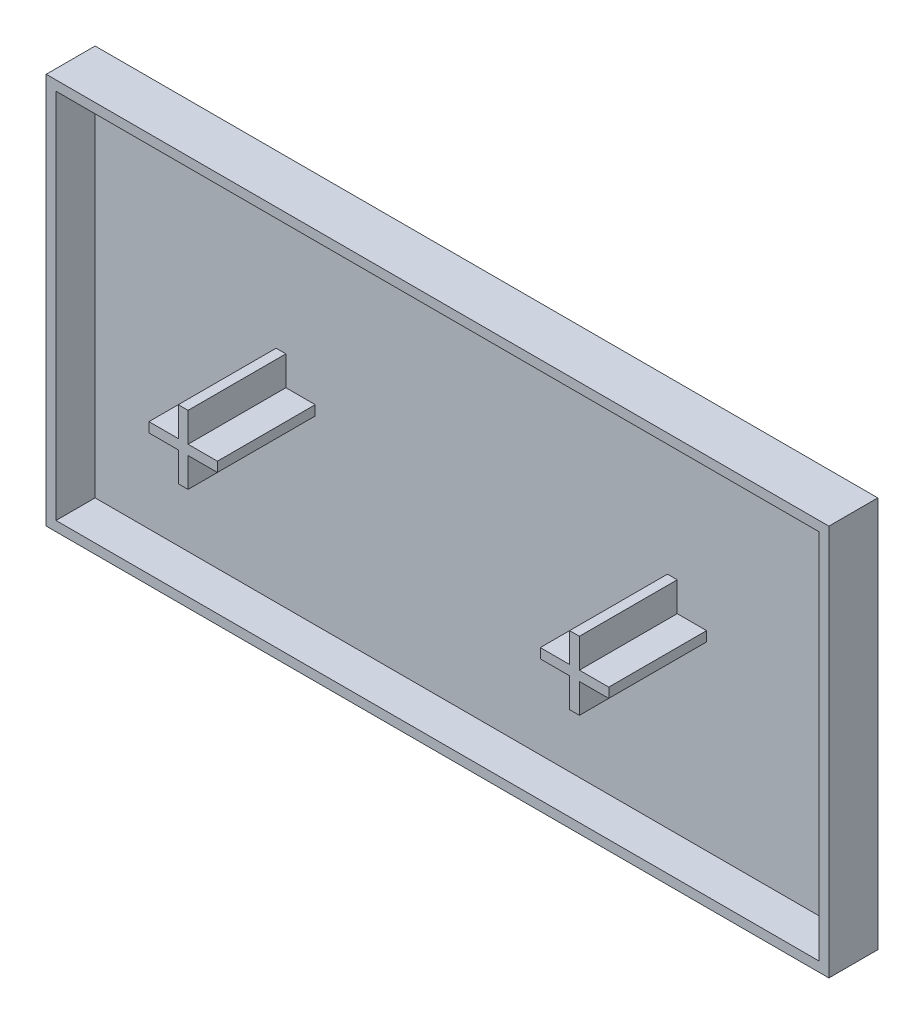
from build123d import *

# Parameters (mm, degrees)
SKETCH_1_W      = 80
SKETCH_1_H      = 40
EXTRUDE_1_DEPTH = 2.5
SHELL_2_T       = -1
EXTRUDE_2_DEPTH = 10


with BuildPart() as part:
    # Sketch 1 → Extrude 1 (new, symmetric)
    with BuildSketch(Plane.XY):
        Rectangle(SKETCH_1_W, SKETCH_1_H)
    extrude(amount=EXTRUDE_1_DEPTH, both=True)

    # Shell 2
    shell_2_openings = [part.faces().sort_by_distance(p)[0] for p in [
        (0, 0, 2.5),
    ]]
    offset(amount=SHELL_2_T, openings=shell_2_openings, kind=Kind.INTERSECTION)

    # Sketch 2 → Extrude 2 (add)
    with BuildSketch(Plane.XY.offset(-1.5)):
        Polygon((-19.5, 0.5), (-16.5, 0.5), (-16.5, -0.5), (-19.5, -0.5), (-19.5, -3.5), (-20.5, -3.5), (-20.5, -0.5), (-23.5, -0.5), (-23.5, 0.5), (-20.5, 0.5), (-20.5, 3.5), (-19.5, 3.5), align=None)
        Polygon((19.5, -0.5), (16.5, -0.5), (16.5, 0.5), (19.5, 0.5), (19.5, 3.5), (20.5, 3.5), (20.5, 0.5), (23.5, 0.5), (23.5, -0.5), (20.5, -0.5), (20.5, -3.5), (19.5, -3.5), align=None)
    extrude(amount=EXTRUDE_2_DEPTH)


solid = part.part
